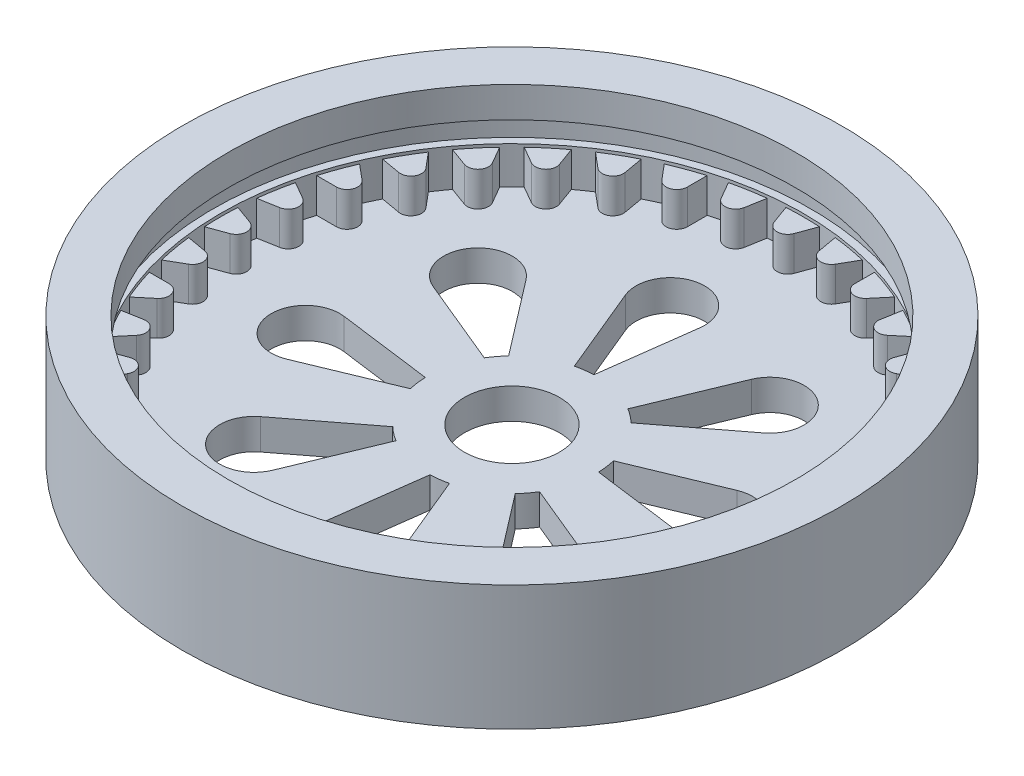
from build123d import *

# Parameters (mm, degrees)
SKETCH6_R           = 21.5
BOSS_EXTRUDE4_DEPTH = 2
SKETCH7_R           = 21.5
SKETCH7_R_2         = 19
BOSS_EXTRUDE5_DEPTH = 2.45
BOSS_EXTRUDE6_DEPTH = 2.25
CIRPATTERN3_COUNT   = 36
SKETCH10_R          = 3.1
CUT_EXTRUDE1_DEPTH  = 2
CUT_EXTRUDE2_DEPTH  = 3
CIRPATTERN4_COUNT   = 8
SKETCH14_R          = 21.5
SKETCH14_R_2        = 19.5
BOSS_EXTRUDE7_DEPTH = 1.7
SKETCH17_R          = 21.5
SKETCH17_R_2        = 18.5
BOSS_EXTRUDE8_DEPTH = 2


with BuildPart() as part:
    # Sketch6 → Boss-Extrude4 (new body)
    with BuildSketch(Plane(origin=(0, 0, 0), x_dir=(1, 0, 0), z_dir=(0, 1, 0))):
        with Locations(Location((0, 0, 0), (0, 0, 270))):
            Circle(SKETCH6_R)
    extrude(amount=BOSS_EXTRUDE4_DEPTH)

    # Sketch7 → Boss-Extrude5 (add)
    with BuildSketch(Plane(origin=(0, 2, 0), x_dir=(1, 0, 0), z_dir=(0, 1, 0))):
        with Locations(Location((0, 0, 0), (0, 0, 270))):
            Circle(SKETCH7_R)
        with Locations(Location((0, 0, 0), (0, 0, 270))):
            Circle(SKETCH7_R_2, mode=Mode.SUBTRACT)
    extrude(amount=BOSS_EXTRUDE5_DEPTH)

    # Sketch8 → Boss-Extrude6 (add)
    with BuildSketch(Plane(origin=(0, 2, 0), x_dir=(1, 0, 0), z_dir=(0, 1, 0))):
        with BuildLine():
            Line((-1.103093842, 19), (1.103093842, 19))
            Line((1.103093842, 19), (0.65, 17.7551349))
            ThreePointArc((0.65, 17.7551349), (0, 17.3), (-0.65, 17.7551349))
            Line((-0.65, 17.7551349), (-1.103093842, 19))
        make_face()
    boss_extrude6 = extrude(amount=BOSS_EXTRUDE6_DEPTH)

    # CirPattern3: Boss-Extrude6 ×36 about axis
    cirpattern3_axis = Axis((0, 0, 0), (0, 1, 0))
    for i in range(1, CIRPATTERN3_COUNT):
        add(boss_extrude6.rotate(cirpattern3_axis, i * 360 / CIRPATTERN3_COUNT))

    # Sketch10 → Cut-Extrude1 (cut)
    with BuildSketch(Plane(origin=(0, 2, 0), x_dir=(1, 0, 0), z_dir=(0, 1, 0))):
        with Locations(Location((0, 0, 0), (0, 0, 270))):
            Circle(SKETCH10_R)
    extrude(amount=-CUT_EXTRUDE1_DEPTH, mode=Mode.SUBTRACT)

    # Sketch16 → Cut-Extrude2 (cut)
    with BuildSketch(Plane(origin=(0, 2, 0), x_dir=(1, 0, 0), z_dir=(0, 1, 0))):
        with BuildLine():
            Line((-0.152374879, 5.497888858), (0.651685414, 11.605333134))
            ThreePointArc((0.651685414, 11.605333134), (-1.858319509, 14.115338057), (-3.633161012, 11.0412224))
            Line((-3.633161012, 11.0412224), (-1.275775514, 5.349990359))
            ThreePointArc((-1.275775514, 5.349990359), (-0.717894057, 5.452946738), (-0.152374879, 5.497888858))
        make_face()
    cut_extrude2 = extrude(amount=-CUT_EXTRUDE2_DEPTH, mode=Mode.SUBTRACT)

    # CirPattern4: Cut-Extrude2 ×8 about axis
    cirpattern4_axis = Axis((0, 0, 0), (0, 1, 0))
    for i in range(1, CIRPATTERN4_COUNT):
        add(cut_extrude2.rotate(cirpattern4_axis, i * 360 / CIRPATTERN4_COUNT), mode=Mode.SUBTRACT)

    # Sketch14 → Boss-Extrude7 (add)
    with BuildSketch(Plane(origin=(0, 4.45, 0), x_dir=(1, 0, 0), z_dir=(0, 1, 0))):
        with Locations(Location((0, 0, 0), (0, 0, 270))):
            Circle(SKETCH14_R)
        with Locations(Location((0, 0, 0), (0, 0, 270))):
            Circle(SKETCH14_R_2, mode=Mode.SUBTRACT)
    extrude(amount=BOSS_EXTRUDE7_DEPTH)

    # Sketch17 → Boss-Extrude8 (add)
    with BuildSketch(Plane(origin=(0, 6.15, 0), x_dir=(1, 0, 0), z_dir=(0, 1, 0))):
        with Locations(Location((0, 0, 0), (0, 0, 270))):
            Circle(SKETCH17_R)
        with Locations(Location((0, 0, 0), (0, 0, 270))):
            Circle(SKETCH17_R_2, mode=Mode.SUBTRACT)
    extrude(amount=BOSS_EXTRUDE8_DEPTH)


solid = part.part
